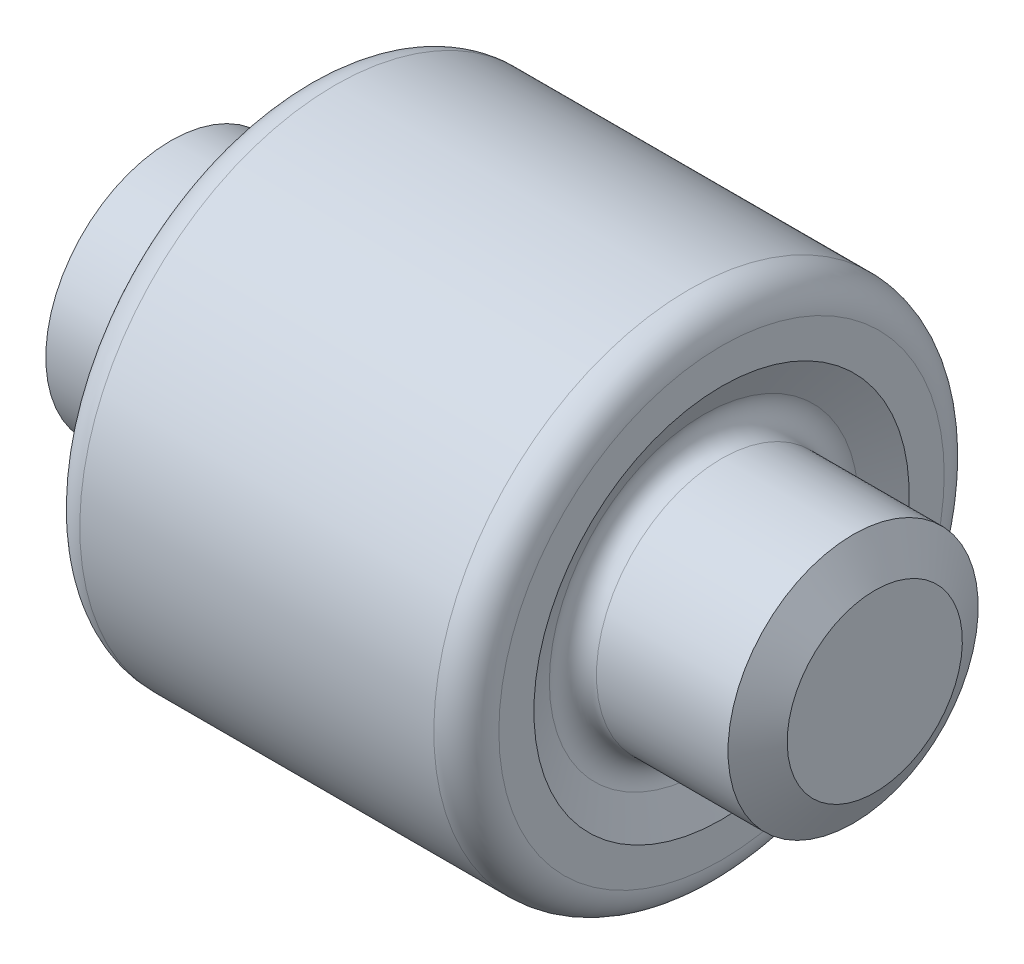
from build123d import *


with BuildPart() as part:
    # Esquisse1 → R_volution1 (revolve)
    with BuildSketch(Plane.XY):
        with BuildLine():
            Line((0, 0), (0, 3.5))
            Line((0, 3.5), (0.866025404, 5))
            Line((0.866025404, 5), (6.125, 5))
            ThreePointArc((6.125, 5), (6.810994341, 5.388403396), (6.830882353, 6.176470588))
            Line((6.830882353, 6.176470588), (6.125, 7.5))
            Line((6.125, 7.5), (6.125, 8.9))
            ThreePointArc((6.125, 8.9), (6.505761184, 9.819238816), (7.425, 10.2))
            Line((7.425, 10.2), (14.5, 10.2))
            Line((14.5, 10.2), (14.5, 0))
            Line((14.5, 0), (0, 0))
        make_face()
    r_volution1 = revolve(axis=Axis((14.5, 0, 0), (-1, 0, 0)))

    # Sym_trie1: R_volution1 across plane
    add(r_volution1.mirror(Plane(origin=(14.5, 10.2, 0), x_dir=(0, 0, 1), z_dir=(1, 0, 0))))


solid = part.part
